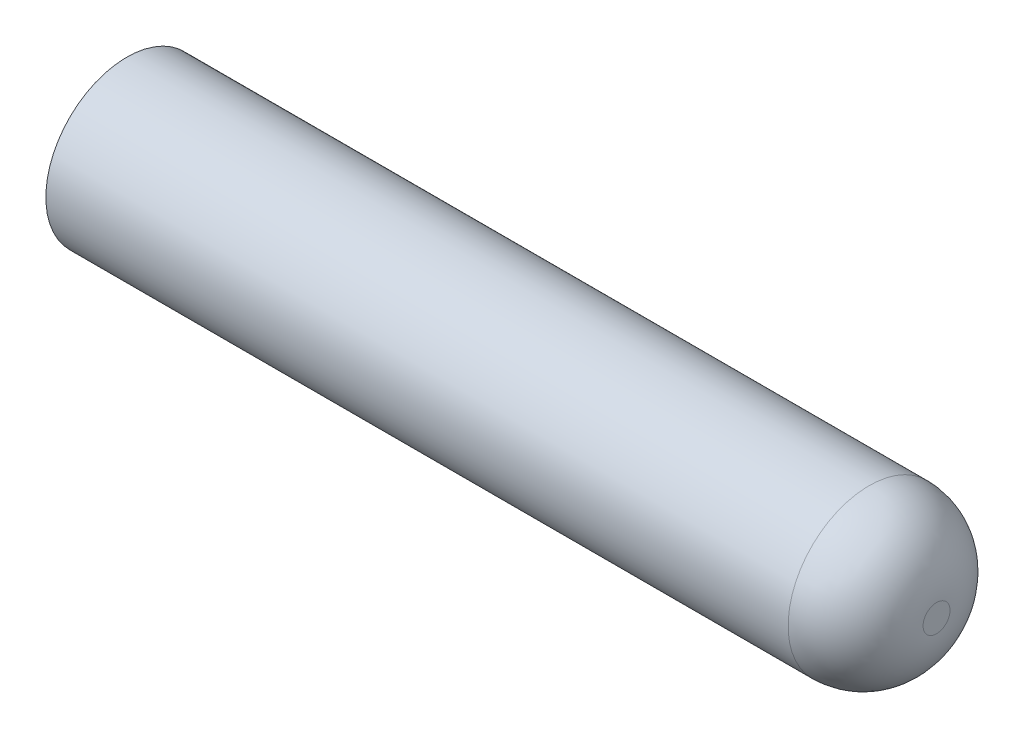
from build123d import *

# Parameters (mm, degrees)
SKETCH1_R      = 3
EXTRUDE1_DEPTH = 30
FILLET1_R      = 2.5
SKETCH2_R      = 1.5
EXTRUDE2_DEPTH = 10


with BuildPart() as part:
    # Sketch1 → Extrude1 (new body)
    with BuildSketch(Plane(origin=(0, 0, 0), x_dir=(0, 0, -1), z_dir=(1, 0, 0))):
        Circle(SKETCH1_R)
    extrude(amount=EXTRUDE1_DEPTH)

    # Fillet1
    fillet1_edges = [part.edges().sort_by_distance(p)[0] for p in [
        (30, 0, 3),
    ]]
    fillet(fillet1_edges, radius=FILLET1_R)

    # Sketch2 → Extrude2 (cut)
    with BuildSketch(Plane.ZY):
        Circle(SKETCH2_R)
    extrude(amount=-EXTRUDE2_DEPTH, mode=Mode.SUBTRACT)


solid = part.part
